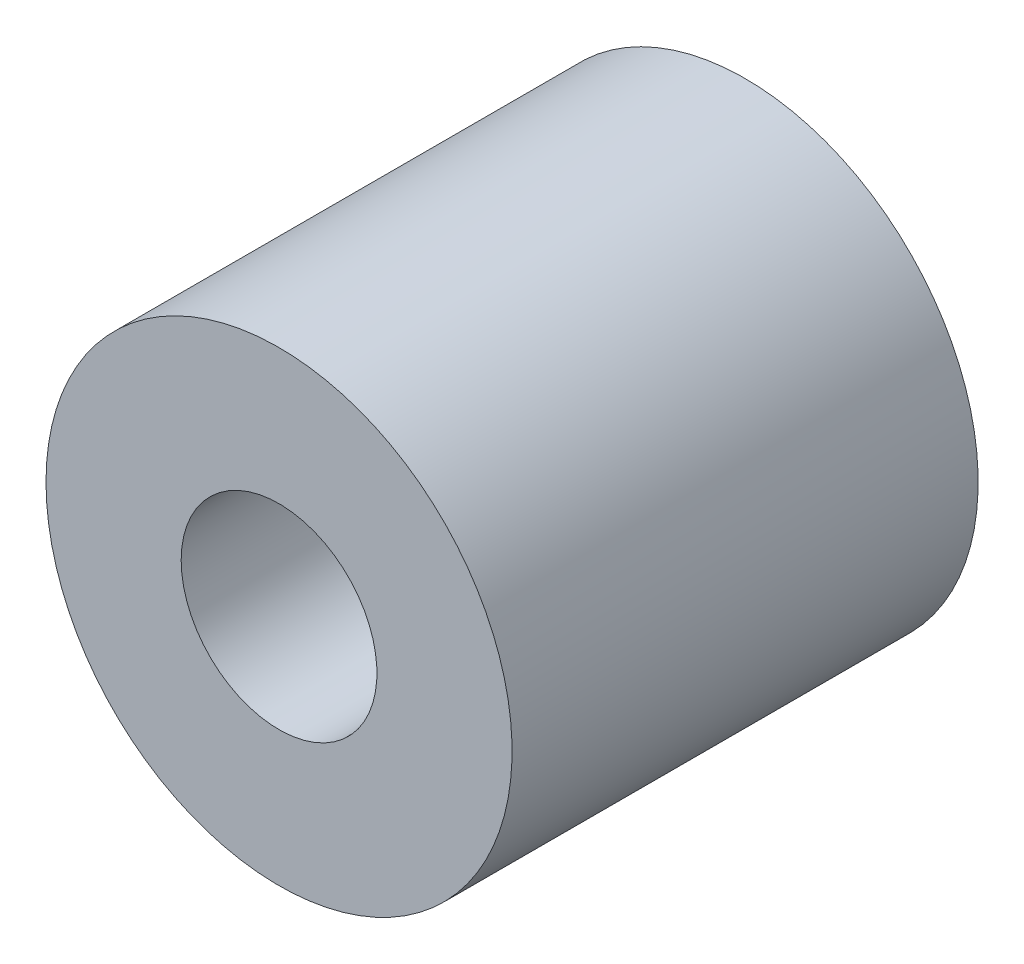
ISO-10303-21;
HEADER;
FILE_DESCRIPTION(('STEP AP214'),'2;1');
FILE_NAME('part.step','',(''),(''),'','','');
FILE_SCHEMA(('AUTOMOTIVE_DESIGN { 1 0 10303 214 1 1 1 1 }'));
ENDSEC;
DATA;
#1=APPLICATION_CONTEXT('core data for automotive mechanical design processes');
#2=APPLICATION_PROTOCOL_DEFINITION('international standard','automotive_design',2000,#1);
#3=PRODUCT_CONTEXT('',#1,'mechanical');
#4=PRODUCT('Part','Part','',(#3));
#5=PRODUCT_RELATED_PRODUCT_CATEGORY('part','',(#4));
#6=PRODUCT_DEFINITION_FORMATION('','',#4);
#7=PRODUCT_DEFINITION_CONTEXT('part definition',#1,'design');
#8=PRODUCT_DEFINITION('design','',#6,#7);
#9=PRODUCT_DEFINITION_SHAPE('','',#8);
#10=(LENGTH_UNIT() NAMED_UNIT(*) SI_UNIT(.MILLI.,.METRE.));
#11=(NAMED_UNIT(*) PLANE_ANGLE_UNIT() SI_UNIT($,.RADIAN.));
#12=(NAMED_UNIT(*) SI_UNIT($,.STERADIAN.) SOLID_ANGLE_UNIT());
#13=UNCERTAINTY_MEASURE_WITH_UNIT(LENGTH_MEASURE(1.E-05),#10,'distance_accuracy_value','');
#14=(GEOMETRIC_REPRESENTATION_CONTEXT(3) GLOBAL_UNCERTAINTY_ASSIGNED_CONTEXT((#13)) GLOBAL_UNIT_ASSIGNED_CONTEXT((#10,
#11,#12)) REPRESENTATION_CONTEXT('',''));
#15=CARTESIAN_POINT('',(0.,0.,0.));
#16=DIRECTION('',(0.,0.,1.));
#17=DIRECTION('',(1.,0.,0.));
#18=AXIS2_PLACEMENT_3D('',#15,#16,#17);
#19=CARTESIAN_POINT('',(0.,0.,19.05));
#20=DIRECTION('',(0.,0.,1.));
#21=DIRECTION('',(1.,0.,0.));
#22=AXIS2_PLACEMENT_3D('',#19,#20,#21);
#23=PLANE('',#22);
#24=CARTESIAN_POINT('',(0.,0.,19.05));
#25=DIRECTION('',(0.,0.,1.));
#26=DIRECTION('',(1.,0.,0.));
#27=AXIS2_PLACEMENT_3D('',#24,#25,#26);
#28=CIRCLE('',#27,9.525);
#29=CARTESIAN_POINT('',(-9.525,0.,19.05));
#30=VERTEX_POINT('',#29);
#31=EDGE_CURVE('E10',#30,#30,#28,.T.);
#32=ORIENTED_EDGE('',*,*,#31,.T.);
#33=EDGE_LOOP('',(#32));
#34=FACE_BOUND('',#33,.T.);
#35=CARTESIAN_POINT('',(0.,0.,19.05));
#36=DIRECTION('',(0.,0.,1.));
#37=DIRECTION('',(1.,0.,0.));
#38=AXIS2_PLACEMENT_3D('',#35,#36,#37);
#39=CIRCLE('',#38,4.0005);
#40=CARTESIAN_POINT('',(-4.0005,0.,19.05));
#41=VERTEX_POINT('',#40);
#42=EDGE_CURVE('E42',#41,#41,#39,.T.);
#43=ORIENTED_EDGE('',*,*,#42,.F.);
#44=EDGE_LOOP('',(#43));
#45=FACE_BOUND('',#44,.T.);
#46=ADVANCED_FACE('F31',(#34,#45),#23,.T.);
#47=CARTESIAN_POINT('',(0.,0.,0.));
#48=DIRECTION('',(0.,0.,1.));
#49=DIRECTION('',(1.,0.,0.));
#50=AXIS2_PLACEMENT_3D('',#47,#48,#49);
#51=PLANE('',#50);
#52=CARTESIAN_POINT('',(0.,0.,0.));
#53=DIRECTION('',(0.,0.,1.));
#54=DIRECTION('',(1.,0.,0.));
#55=AXIS2_PLACEMENT_3D('',#52,#53,#54);
#56=CIRCLE('',#55,9.525);
#57=CARTESIAN_POINT('',(-9.525,0.,0.));
#58=VERTEX_POINT('',#57);
#59=EDGE_CURVE('E35',#58,#58,#56,.T.);
#60=ORIENTED_EDGE('',*,*,#59,.F.);
#61=EDGE_LOOP('',(#60));
#62=FACE_BOUND('',#61,.T.);
#63=CARTESIAN_POINT('',(0.,0.,0.));
#64=DIRECTION('',(0.,0.,1.));
#65=DIRECTION('',(1.,0.,0.));
#66=AXIS2_PLACEMENT_3D('',#63,#64,#65);
#67=CIRCLE('',#66,4.0005);
#68=CARTESIAN_POINT('',(-4.0005,0.,0.));
#69=VERTEX_POINT('',#68);
#70=EDGE_CURVE('E44',#69,#69,#67,.T.);
#71=ORIENTED_EDGE('',*,*,#70,.T.);
#72=EDGE_LOOP('',(#71));
#73=FACE_BOUND('',#72,.T.);
#74=ADVANCED_FACE('F54',(#62,#73),#51,.F.);
#75=CARTESIAN_POINT('',(0.,0.,19.05));
#76=DIRECTION('',(0.,0.,-1.));
#77=DIRECTION('',(-1.,0.,0.));
#78=AXIS2_PLACEMENT_3D('',#75,#76,#77);
#79=CYLINDRICAL_SURFACE('',#78,9.525);
#80=CARTESIAN_POINT('',(-9.525,0.,19.05));
#81=CARTESIAN_POINT('',(-9.525,0.,18.8515625));
#82=CARTESIAN_POINT('',(-9.525,0.,18.653125));
#83=CARTESIAN_POINT('',(-9.525,0.,18.25625));
#84=CARTESIAN_POINT('',(-9.525,0.,18.0578125));
#85=CARTESIAN_POINT('',(-9.525,0.,17.6609375));
#86=CARTESIAN_POINT('',(-9.525,0.,17.4625));
#87=CARTESIAN_POINT('',(-9.525,0.,17.065625));
#88=CARTESIAN_POINT('',(-9.525,0.,16.8671875));
#89=CARTESIAN_POINT('',(-9.525,0.,16.4703125));
#90=CARTESIAN_POINT('',(-9.525,0.,16.271875));
#91=CARTESIAN_POINT('',(-9.525,0.,15.875));
#92=CARTESIAN_POINT('',(-9.525,0.,15.6765625));
#93=CARTESIAN_POINT('',(-9.525,0.,15.2796875));
#94=CARTESIAN_POINT('',(-9.525,0.,15.08125));
#95=CARTESIAN_POINT('',(-9.525,0.,14.684375));
#96=CARTESIAN_POINT('',(-9.525,0.,14.4859375));
#97=CARTESIAN_POINT('',(-9.525,0.,14.0890625));
#98=CARTESIAN_POINT('',(-9.525,0.,13.890625));
#99=CARTESIAN_POINT('',(-9.525,0.,13.49375));
#100=CARTESIAN_POINT('',(-9.525,0.,13.2953125));
#101=CARTESIAN_POINT('',(-9.525,0.,12.8984375));
#102=CARTESIAN_POINT('',(-9.525,0.,12.7));
#103=CARTESIAN_POINT('',(-9.525,0.,12.303125));
#104=CARTESIAN_POINT('',(-9.525,0.,12.1046875));
#105=CARTESIAN_POINT('',(-9.525,0.,11.7078125));
#106=CARTESIAN_POINT('',(-9.525,0.,11.509375));
#107=CARTESIAN_POINT('',(-9.525,0.,11.1125));
#108=CARTESIAN_POINT('',(-9.525,0.,10.9140625));
#109=CARTESIAN_POINT('',(-9.525,0.,10.5171875));
#110=CARTESIAN_POINT('',(-9.525,0.,10.31875));
#111=CARTESIAN_POINT('',(-9.525,0.,9.921875));
#112=CARTESIAN_POINT('',(-9.525,0.,9.7234375));
#113=CARTESIAN_POINT('',(-9.525,0.,9.3265625));
#114=CARTESIAN_POINT('',(-9.525,0.,9.128125));
#115=CARTESIAN_POINT('',(-9.525,0.,8.73125));
#116=CARTESIAN_POINT('',(-9.525,0.,8.5328125));
#117=CARTESIAN_POINT('',(-9.525,0.,8.1359375));
#118=CARTESIAN_POINT('',(-9.525,0.,7.9375));
#119=CARTESIAN_POINT('',(-9.525,0.,7.540625));
#120=CARTESIAN_POINT('',(-9.525,0.,7.3421875));
#121=CARTESIAN_POINT('',(-9.525,0.,6.9453125));
#122=CARTESIAN_POINT('',(-9.525,0.,6.746875));
#123=CARTESIAN_POINT('',(-9.525,0.,6.35));
#124=CARTESIAN_POINT('',(-9.525,0.,6.1515625));
#125=CARTESIAN_POINT('',(-9.525,0.,5.7546875));
#126=CARTESIAN_POINT('',(-9.525,0.,5.55625));
#127=CARTESIAN_POINT('',(-9.525,0.,5.159375));
#128=CARTESIAN_POINT('',(-9.525,0.,4.9609375));
#129=CARTESIAN_POINT('',(-9.525,0.,4.5640625));
#130=CARTESIAN_POINT('',(-9.525,0.,4.365625));
#131=CARTESIAN_POINT('',(-9.525,0.,3.96875));
#132=CARTESIAN_POINT('',(-9.525,0.,3.7703125));
#133=CARTESIAN_POINT('',(-9.525,0.,3.3734375));
#134=CARTESIAN_POINT('',(-9.525,0.,3.175));
#135=CARTESIAN_POINT('',(-9.525,0.,2.778125));
#136=CARTESIAN_POINT('',(-9.525,0.,2.5796875));
#137=CARTESIAN_POINT('',(-9.525,0.,2.1828125));
#138=CARTESIAN_POINT('',(-9.525,0.,1.984375));
#139=CARTESIAN_POINT('',(-9.525,0.,1.5875));
#140=CARTESIAN_POINT('',(-9.525,0.,1.3890625));
#141=CARTESIAN_POINT('',(-9.525,0.,0.992187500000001));
#142=CARTESIAN_POINT('',(-9.525,0.,0.793750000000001));
#143=CARTESIAN_POINT('',(-9.525,0.,0.396875));
#144=CARTESIAN_POINT('',(-9.525,0.,0.1984375));
#145=CARTESIAN_POINT('',(-9.525,0.,0.));
#146=B_SPLINE_CURVE_WITH_KNOTS('',3,(#80,#81,#82,#83,#84,#85,#86,#87,#88,#89,#90,#91,#92,#93,
#94,#95,#96,#97,#98,#99,#100,#101,#102,#103,#104,#105,#106,#107,#108,#109,#110,#111,#112,#113,
#114,#115,#116,#117,#118,#119,#120,#121,#122,#123,#124,#125,#126,#127,#128,#129,#130,#131,#132,
#133,#134,#135,#136,#137,#138,#139,#140,#141,#142,#143,#144,#145),.UNSPECIFIED.,.F.,.F.,(4,2,2,
2,2,2,2,2,2,2,2,2,2,2,2,2,2,2,2,2,2,2,2,2,2,2,2,2,2,2,2,2,4),(0.,0.5953125,1.190625,1.7859375,
2.38125,2.9765625,3.571875,4.1671875,4.7625,5.3578125,5.953125,6.5484375,7.14375,7.7390625,
8.334375,8.9296875,9.525,10.1203125,10.715625,11.3109375,11.90625,12.5015625,13.096875,
13.6921875,14.2875,14.8828125,15.478125,16.0734375,16.66875,17.2640625,17.859375,18.4546875,
19.05),.UNSPECIFIED.);
#147=EDGE_CURVE('BSEAM33',#30,#58,#146,.T.);
#148=ORIENTED_EDGE('',*,*,#31,.F.);
#149=ORIENTED_EDGE('',*,*,#59,.T.);
#150=ORIENTED_EDGE('',*,*,#147,.T.);
#151=ORIENTED_EDGE('',*,*,#147,.F.);
#152=EDGE_LOOP('',(#148,#150,#149,#151));
#153=FACE_BOUND('',#152,.T.);
#154=ADVANCED_FACE('F33',(#153),#79,.T.);
#155=CARTESIAN_POINT('',(0.,0.,19.05));
#156=DIRECTION('',(0.,0.,-1.));
#157=DIRECTION('',(-1.,0.,0.));
#158=AXIS2_PLACEMENT_3D('',#155,#156,#157);
#159=CYLINDRICAL_SURFACE('',#158,4.0005);
#160=CARTESIAN_POINT('',(-4.0005,0.,19.05));
#161=CARTESIAN_POINT('',(-4.0005,0.,18.8515625));
#162=CARTESIAN_POINT('',(-4.0005,0.,18.653125));
#163=CARTESIAN_POINT('',(-4.0005,0.,18.25625));
#164=CARTESIAN_POINT('',(-4.0005,0.,18.0578125));
#165=CARTESIAN_POINT('',(-4.0005,0.,17.6609375));
#166=CARTESIAN_POINT('',(-4.0005,0.,17.4625));
#167=CARTESIAN_POINT('',(-4.0005,0.,17.065625));
#168=CARTESIAN_POINT('',(-4.0005,0.,16.8671875));
#169=CARTESIAN_POINT('',(-4.0005,0.,16.4703125));
#170=CARTESIAN_POINT('',(-4.0005,0.,16.271875));
#171=CARTESIAN_POINT('',(-4.0005,0.,15.875));
#172=CARTESIAN_POINT('',(-4.0005,0.,15.6765625));
#173=CARTESIAN_POINT('',(-4.0005,0.,15.2796875));
#174=CARTESIAN_POINT('',(-4.0005,0.,15.08125));
#175=CARTESIAN_POINT('',(-4.0005,0.,14.684375));
#176=CARTESIAN_POINT('',(-4.0005,0.,14.4859375));
#177=CARTESIAN_POINT('',(-4.0005,0.,14.0890625));
#178=CARTESIAN_POINT('',(-4.0005,0.,13.890625));
#179=CARTESIAN_POINT('',(-4.0005,0.,13.49375));
#180=CARTESIAN_POINT('',(-4.0005,0.,13.2953125));
#181=CARTESIAN_POINT('',(-4.0005,0.,12.8984375));
#182=CARTESIAN_POINT('',(-4.0005,0.,12.7));
#183=CARTESIAN_POINT('',(-4.0005,0.,12.303125));
#184=CARTESIAN_POINT('',(-4.0005,0.,12.1046875));
#185=CARTESIAN_POINT('',(-4.0005,0.,11.7078125));
#186=CARTESIAN_POINT('',(-4.0005,0.,11.509375));
#187=CARTESIAN_POINT('',(-4.0005,0.,11.1125));
#188=CARTESIAN_POINT('',(-4.0005,0.,10.9140625));
#189=CARTESIAN_POINT('',(-4.0005,0.,10.5171875));
#190=CARTESIAN_POINT('',(-4.0005,0.,10.31875));
#191=CARTESIAN_POINT('',(-4.0005,0.,9.921875));
#192=CARTESIAN_POINT('',(-4.0005,0.,9.7234375));
#193=CARTESIAN_POINT('',(-4.0005,0.,9.3265625));
#194=CARTESIAN_POINT('',(-4.0005,0.,9.128125));
#195=CARTESIAN_POINT('',(-4.0005,0.,8.73125));
#196=CARTESIAN_POINT('',(-4.0005,0.,8.5328125));
#197=CARTESIAN_POINT('',(-4.0005,0.,8.1359375));
#198=CARTESIAN_POINT('',(-4.0005,0.,7.9375));
#199=CARTESIAN_POINT('',(-4.0005,0.,7.540625));
#200=CARTESIAN_POINT('',(-4.0005,0.,7.3421875));
#201=CARTESIAN_POINT('',(-4.0005,0.,6.9453125));
#202=CARTESIAN_POINT('',(-4.0005,0.,6.746875));
#203=CARTESIAN_POINT('',(-4.0005,0.,6.35));
#204=CARTESIAN_POINT('',(-4.0005,0.,6.1515625));
#205=CARTESIAN_POINT('',(-4.0005,0.,5.7546875));
#206=CARTESIAN_POINT('',(-4.0005,0.,5.55625));
#207=CARTESIAN_POINT('',(-4.0005,0.,5.159375));
#208=CARTESIAN_POINT('',(-4.0005,0.,4.9609375));
#209=CARTESIAN_POINT('',(-4.0005,0.,4.5640625));
#210=CARTESIAN_POINT('',(-4.0005,0.,4.365625));
#211=CARTESIAN_POINT('',(-4.0005,0.,3.96875));
#212=CARTESIAN_POINT('',(-4.0005,0.,3.7703125));
#213=CARTESIAN_POINT('',(-4.0005,0.,3.3734375));
#214=CARTESIAN_POINT('',(-4.0005,0.,3.175));
#215=CARTESIAN_POINT('',(-4.0005,0.,2.778125));
#216=CARTESIAN_POINT('',(-4.0005,0.,2.5796875));
#217=CARTESIAN_POINT('',(-4.0005,0.,2.1828125));
#218=CARTESIAN_POINT('',(-4.0005,0.,1.984375));
#219=CARTESIAN_POINT('',(-4.0005,0.,1.5875));
#220=CARTESIAN_POINT('',(-4.0005,0.,1.3890625));
#221=CARTESIAN_POINT('',(-4.0005,0.,0.992187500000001));
#222=CARTESIAN_POINT('',(-4.0005,0.,0.793750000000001));
#223=CARTESIAN_POINT('',(-4.0005,0.,0.396875));
#224=CARTESIAN_POINT('',(-4.0005,0.,0.1984375));
#225=CARTESIAN_POINT('',(-4.0005,0.,0.));
#226=B_SPLINE_CURVE_WITH_KNOTS('',3,(#160,#161,#162,#163,#164,#165,#166,#167,#168,#169,#170,
#171,#172,#173,#174,#175,#176,#177,#178,#179,#180,#181,#182,#183,#184,#185,#186,#187,#188,#189,
#190,#191,#192,#193,#194,#195,#196,#197,#198,#199,#200,#201,#202,#203,#204,#205,#206,#207,#208,
#209,#210,#211,#212,#213,#214,#215,#216,#217,#218,#219,#220,#221,#222,#223,#224,#225),
.UNSPECIFIED.,.F.,.F.,(4,2,2,2,2,2,2,2,2,2,2,2,2,2,2,2,2,2,2,2,2,2,2,2,2,2,2,2,2,2,2,2,4),(0.,
0.595312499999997,1.190625,1.7859375,2.38125,2.9765625,3.571875,4.1671875,4.7625,5.3578125,
5.953125,6.5484375,7.14375,7.7390625,8.334375,8.9296875,9.525,10.1203125,10.715625,11.3109375,
11.90625,12.5015625,13.096875,13.6921875,14.2875,14.8828125,15.478125,16.0734375,16.66875,
17.2640625,17.859375,18.4546875,19.05),.UNSPECIFIED.);
#227=EDGE_CURVE('BSEAM50',#41,#69,#226,.T.);
#228=ORIENTED_EDGE('',*,*,#42,.T.);
#229=ORIENTED_EDGE('',*,*,#70,.F.);
#230=ORIENTED_EDGE('',*,*,#227,.T.);
#231=ORIENTED_EDGE('',*,*,#227,.F.);
#232=EDGE_LOOP('',(#228,#230,#229,#231));
#233=FACE_BOUND('',#232,.T.);
#234=ADVANCED_FACE('F50',(#233),#159,.F.);
#235=CLOSED_SHELL('',(#46,#74,#154,#234));
#236=MANIFOLD_SOLID_BREP('B2',#235);
#237=ADVANCED_BREP_SHAPE_REPRESENTATION('',(#18,#236),#14);
#238=SHAPE_DEFINITION_REPRESENTATION(#9,#237);
ENDSEC;
END-ISO-10303-21;
